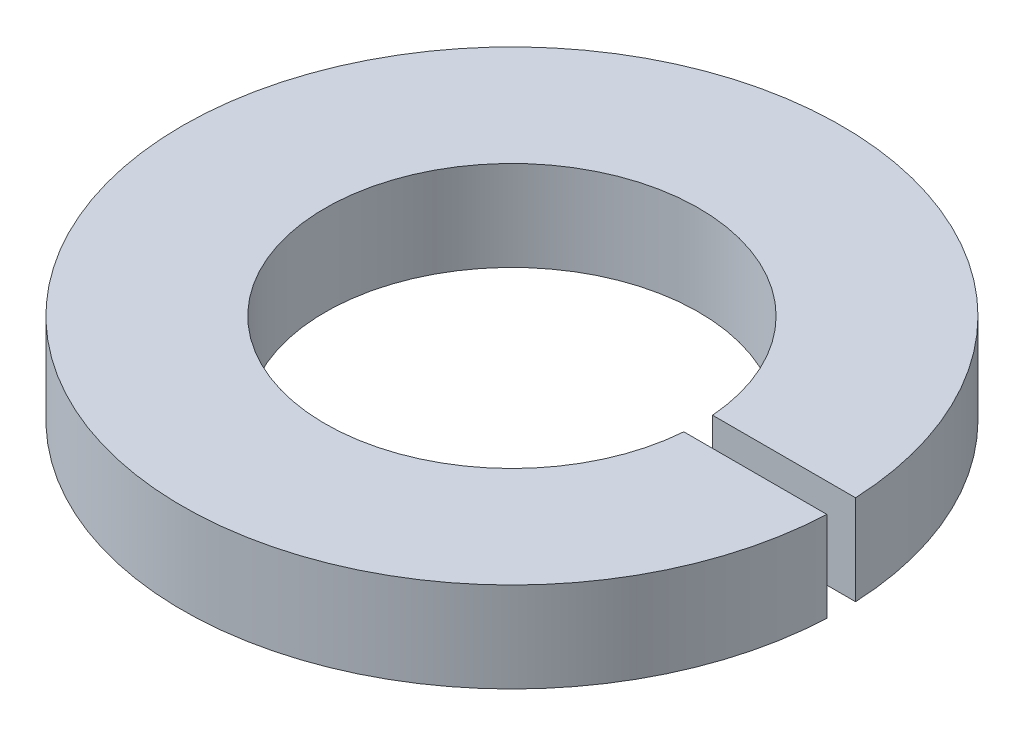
from build123d import *

# Parameters (mm, degrees)
SKETCH1_R          = 8.7376
SKETCH1_R_2        = 4.953
BASE_EXTRUDE_DEPTH = 2.3876
CUT_EXTRUDE1_DEPTH = 13.58538602


with BuildPart() as part:
    # Sketch1 → Base-Extrude (new body)
    with BuildSketch(Plane(origin=(0, 0, 0), x_dir=(1, 0, 0), z_dir=(0, 1, 0))):
        with Locations(Location((0, 0, 0), (0, 0, 270))):
            Circle(SKETCH1_R)
        with Locations(Location((0, 0, 0), (0, 0, 270))):
            Circle(SKETCH1_R_2, mode=Mode.SUBTRACT)
    extrude(amount=BASE_EXTRUDE_DEPTH)

    # Sketch2 → Cut-Extrude1 (cut, through all)
    with BuildSketch(Plane(origin=(0, 2.3876, 0), x_dir=(-1, 0, 0), z_dir=(0, 1, 0))):
        with BuildLine():
            Line((-8.729289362, -0.381), (0, -0.381))
            Line((0, -0.381), (0, 0.381))
            Line((0, 0.381), (-8.729289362, 0.381))
            ThreePointArc((-8.729289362, 0.381), (-8.7376, 0), (-8.729289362, -0.381))
        make_face()
    extrude(amount=-CUT_EXTRUDE1_DEPTH, mode=Mode.SUBTRACT)


solid = part.part
